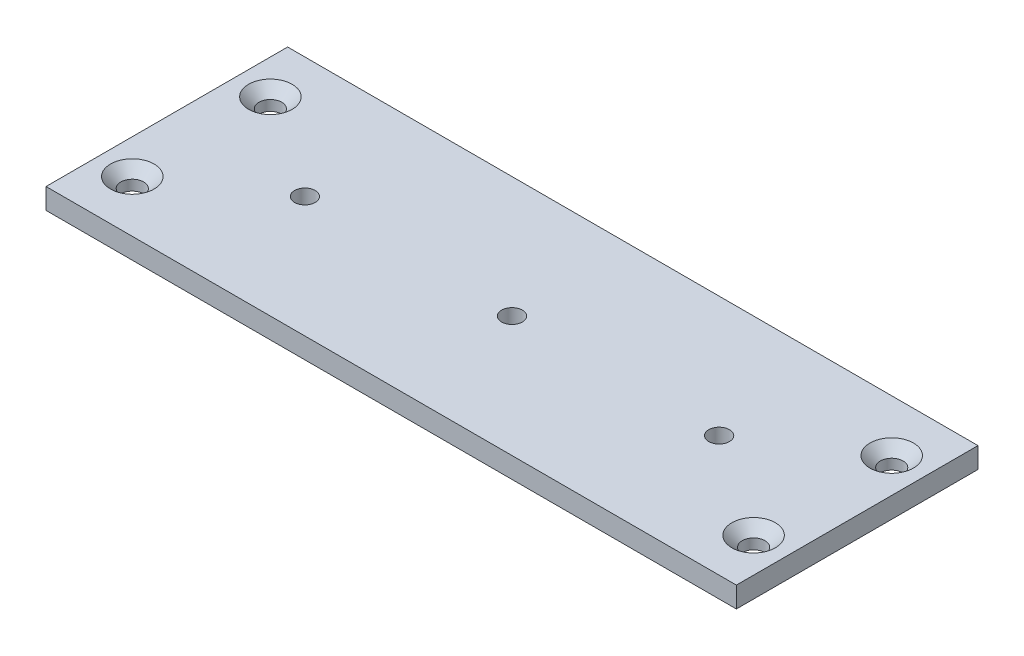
from build123d import *

# Parameters (mm, degrees)
SKETCH1_W                                    = 200
SKETCH1_H                                    = 70
EXTRUDE1_DEPTH                               = 6
SKETCH2_R                                    = 3
EXTRUDE2_DEPTH                               = 212.981131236
CSK_FOR_M6_COUNTERSUNK_FLAT_HEAD_SCR_2_COUNT = 2
CSK_FOR_M6_COUNTERSUNK_FLAT_HEAD_SCR_2_PITCH = 40
CSK_FOR_M6_COUNTERSUNK_FLAT_HEAD_SCR_3_COUNT = 2
CSK_FOR_M6_COUNTERSUNK_FLAT_HEAD_SCR_3_PITCH = 180
CSK_FOR_M6_COUNTERSUNK_FLAT_HEAD_SCR_4_COUNT = 2
CSK_FOR_M6_COUNTERSUNK_FLAT_HEAD_SCR_4_PITCH = 184.390889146


with BuildPart() as part:
    # Sketch1 → Extrude1 (new body)
    with BuildSketch(Plane(origin=(0, 0, 0), x_dir=(1, 0, 0), z_dir=(0, 1, 0))):
        with Locations((100, 35)):
            Rectangle(SKETCH1_W, SKETCH1_H)
    extrude(amount=EXTRUDE1_DEPTH)

    # Sketch2 → Extrude2 (cut, through all)
    with BuildSketch(Plane(origin=(0, 6, 0), x_dir=(1, 0, 0), z_dir=(0, 1, 0))):
        with Locations(Location((100, 35, 0), (0, 0, 270))):
            Circle(SKETCH2_R)
        with Locations(Location((40, 35, 0), (0, 0, 270))):
            Circle(SKETCH2_R)
        with Locations(Location((160, 35, 0), (0, 0, 270))):
            Circle(SKETCH2_R)
    extrude(amount=-EXTRUDE2_DEPTH, mode=Mode.SUBTRACT)

    # Sketch5 → CSK for M6 Countersunk Flat Head Screw1 (revolve, cut)
    with BuildSketch(Plane(origin=(10, 6, -55), x_dir=(0, 0, 1), z_dir=(1, 0, 0))):
        Polygon((0, 0), (0, 6), (3.3, 6), (3.3, 3), (6.3, 0), align=None)
    csk_for_m6_countersunk_flat_head_screw1 = revolve(axis=Axis((10, 12.35, -55), (0, -1, 0)), mode=Mode.SUBTRACT)

    # CSK for M6 Countersunk Flat Head Scr 2: CSK for M6 Countersunk Flat Head Screw1 ×2
    with Locations(*[(0, 0, i * CSK_FOR_M6_COUNTERSUNK_FLAT_HEAD_SCR_2_PITCH) for i in range(1, CSK_FOR_M6_COUNTERSUNK_FLAT_HEAD_SCR_2_COUNT)]):
        add(csk_for_m6_countersunk_flat_head_screw1, mode=Mode.SUBTRACT)

    # CSK for M6 Countersunk Flat Head Scr 3: CSK for M6 Countersunk Flat Head Screw1 ×2
    with Locations(*[(i * CSK_FOR_M6_COUNTERSUNK_FLAT_HEAD_SCR_3_PITCH, 0, 0) for i in range(1, CSK_FOR_M6_COUNTERSUNK_FLAT_HEAD_SCR_3_COUNT)]):
        add(csk_for_m6_countersunk_flat_head_screw1, mode=Mode.SUBTRACT)

    # CSK for M6 Countersunk Flat Head Scr 4: CSK for M6 Countersunk Flat Head Screw1 ×2
    with Locations(*[Vector(0.9761870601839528, 0, 0.216930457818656) * (i * CSK_FOR_M6_COUNTERSUNK_FLAT_HEAD_SCR_4_PITCH) for i in range(1, CSK_FOR_M6_COUNTERSUNK_FLAT_HEAD_SCR_4_COUNT)]):
        add(csk_for_m6_countersunk_flat_head_screw1, mode=Mode.SUBTRACT)


solid = part.part
